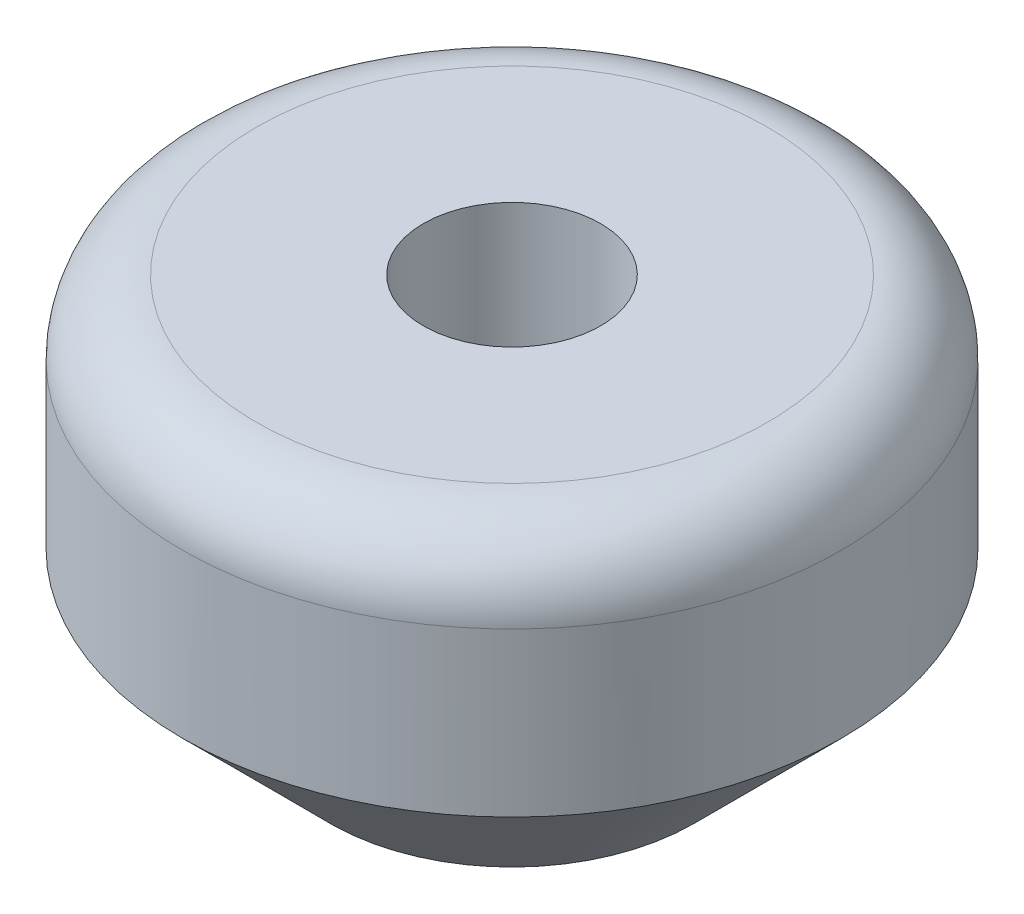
ISO-10303-21;
HEADER;
FILE_DESCRIPTION(('STEP AP214'),'2;1');
FILE_NAME('part.step','',(''),(''),'','','');
FILE_SCHEMA(('AUTOMOTIVE_DESIGN { 1 0 10303 214 1 1 1 1 }'));
ENDSEC;
DATA;
#1=APPLICATION_CONTEXT('core data for automotive mechanical design processes');
#2=APPLICATION_PROTOCOL_DEFINITION('international standard','automotive_design',2000,#1);
#3=PRODUCT_CONTEXT('',#1,'mechanical');
#4=PRODUCT('Part','Part','',(#3));
#5=PRODUCT_RELATED_PRODUCT_CATEGORY('part','',(#4));
#6=PRODUCT_DEFINITION_FORMATION('','',#4);
#7=PRODUCT_DEFINITION_CONTEXT('part definition',#1,'design');
#8=PRODUCT_DEFINITION('design','',#6,#7);
#9=PRODUCT_DEFINITION_SHAPE('','',#8);
#10=(LENGTH_UNIT() NAMED_UNIT(*) SI_UNIT(.MILLI.,.METRE.));
#11=(NAMED_UNIT(*) PLANE_ANGLE_UNIT() SI_UNIT($,.RADIAN.));
#12=(NAMED_UNIT(*) SI_UNIT($,.STERADIAN.) SOLID_ANGLE_UNIT());
#13=UNCERTAINTY_MEASURE_WITH_UNIT(LENGTH_MEASURE(1.E-05),#10,'distance_accuracy_value','');
#14=(GEOMETRIC_REPRESENTATION_CONTEXT(3) GLOBAL_UNCERTAINTY_ASSIGNED_CONTEXT((#13)) GLOBAL_UNIT_ASSIGNED_CONTEXT((#10,
#11,#12)) REPRESENTATION_CONTEXT('',''));
#15=CARTESIAN_POINT('',(0.,0.,0.));
#16=DIRECTION('',(0.,0.,1.));
#17=DIRECTION('',(1.,0.,0.));
#18=AXIS2_PLACEMENT_3D('',#15,#16,#17);
#19=CARTESIAN_POINT('',(-44.6030028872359,-133.507535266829,0.));
#20=DIRECTION('',(0.,-1.,0.));
#21=DIRECTION('',(1.,0.,0.));
#22=AXIS2_PLACEMENT_3D('',#19,#20,#21);
#23=PLANE('',#22);
#24=CARTESIAN_POINT('',(-1.1508312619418E-13,-133.507535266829,0.));
#25=DIRECTION('',(0.,-1.,0.));
#26=DIRECTION('',(1.,0.,0.));
#27=AXIS2_PLACEMENT_3D('',#24,#25,#26);
#28=CIRCLE('',#27,24.6030028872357);
#29=CARTESIAN_POINT('',(24.6030028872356,-133.507535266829,0.));
#30=VERTEX_POINT('',#29);
#31=EDGE_CURVE('E40',#30,#30,#28,.T.);
#32=ORIENTED_EDGE('',*,*,#31,.T.);
#33=EDGE_LOOP('',(#32));
#34=FACE_BOUND('',#33,.T.);
#35=CARTESIAN_POINT('',(-1.1508312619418E-13,-133.507535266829,0.));
#36=DIRECTION('',(0.,1.,0.));
#37=DIRECTION('',(-1.,0.,0.));
#38=AXIS2_PLACEMENT_3D('',#35,#36,#37);
#39=CIRCLE('',#38,8.00000000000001);
#40=CARTESIAN_POINT('',(-8.00000000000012,-133.507535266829,0.));
#41=VERTEX_POINT('',#40);
#42=EDGE_CURVE('E49',#41,#41,#39,.T.);
#43=ORIENTED_EDGE('',*,*,#42,.T.);
#44=EDGE_LOOP('',(#43));
#45=FACE_BOUND('',#44,.T.);
#46=ADVANCED_FACE('F30',(#34,#45),#23,.T.);
#47=CARTESIAN_POINT('',(-1.13107492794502E-13,-83.162980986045,0.));
#48=DIRECTION('',(0.,1.,0.));
#49=DIRECTION('',(-1.,0.,0.));
#50=AXIS2_PLACEMENT_3D('',#47,#48,#49);
#51=CYLINDRICAL_SURFACE('',#50,8.00000000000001);
#52=CARTESIAN_POINT('',(-1.14564843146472E-13,-120.300262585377,0.));
#53=DIRECTION('',(0.,1.,0.));
#54=DIRECTION('',(-1.,0.,0.));
#55=AXIS2_PLACEMENT_3D('',#52,#53,#54);
#56=CIRCLE('',#55,8.00000000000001);
#57=CARTESIAN_POINT('',(-8.00000000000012,-120.300262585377,0.));
#58=VERTEX_POINT('',#57);
#59=EDGE_CURVE('E52',#58,#58,#56,.T.);
#60=ORIENTED_EDGE('',*,*,#59,.T.);
#61=EDGE_LOOP('',(#60));
#62=FACE_BOUND('',#61,.T.);
#63=ORIENTED_EDGE('',*,*,#42,.F.);
#64=EDGE_LOOP('',(#63));
#65=FACE_BOUND('',#64,.T.);
#66=ADVANCED_FACE('F78',(#62,#65),#51,.F.);
#67=CARTESIAN_POINT('',(-1.14564843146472E-13,-120.300262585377,0.));
#68=DIRECTION('',(0.,1.,0.));
#69=DIRECTION('',(-1.,0.,0.));
#70=AXIS2_PLACEMENT_3D('',#67,#68,#69);
#71=CONICAL_SURFACE('',#70,8.00000000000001,0.189985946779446);
#72=CARTESIAN_POINT('',(-1.13748594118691E-13,-99.5,0.));
#73=DIRECTION('',(0.,1.,0.));
#74=DIRECTION('',(-1.,0.,0.));
#75=AXIS2_PLACEMENT_3D('',#72,#73,#74);
#76=CIRCLE('',#75,11.9999999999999);
#77=CARTESIAN_POINT('',(-12.,-99.5,0.));
#78=VERTEX_POINT('',#77);
#79=EDGE_CURVE('E55',#78,#78,#76,.T.);
#80=ORIENTED_EDGE('',*,*,#79,.T.);
#81=EDGE_LOOP('',(#80));
#82=FACE_BOUND('',#81,.T.);
#83=ORIENTED_EDGE('',*,*,#59,.F.);
#84=EDGE_LOOP('',(#83));
#85=FACE_BOUND('',#84,.T.);
#86=ADVANCED_FACE('F75',(#82,#85),#71,.F.);
#87=CARTESIAN_POINT('',(-1.13107492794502E-13,-83.162980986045,0.));
#88=DIRECTION('',(0.,1.,0.));
#89=DIRECTION('',(-1.,0.,0.));
#90=AXIS2_PLACEMENT_3D('',#87,#88,#89);
#91=CYLINDRICAL_SURFACE('',#90,11.9999999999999);
#92=CARTESIAN_POINT('',(-1.13040783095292E-13,-81.4630349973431,0.));
#93=DIRECTION('',(0.,1.,0.));
#94=DIRECTION('',(-1.,0.,0.));
#95=AXIS2_PLACEMENT_3D('',#92,#93,#94);
#96=CIRCLE('',#95,11.9999999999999);
#97=CARTESIAN_POINT('',(-12.,-81.4630349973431,0.));
#98=VERTEX_POINT('',#97);
#99=EDGE_CURVE('E58',#98,#98,#96,.T.);
#100=ORIENTED_EDGE('',*,*,#99,.T.);
#101=EDGE_LOOP('',(#100));
#102=FACE_BOUND('',#101,.T.);
#103=ORIENTED_EDGE('',*,*,#79,.F.);
#104=EDGE_LOOP('',(#103));
#105=FACE_BOUND('',#104,.T.);
#106=ADVANCED_FACE('F62',(#102,#105),#91,.F.);
#107=CARTESIAN_POINT('',(-12.,-81.4630349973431,0.));
#108=DIRECTION('',(0.,1.,0.));
#109=DIRECTION('',(-1.,0.,0.));
#110=AXIS2_PLACEMENT_3D('',#107,#108,#109);
#111=PLANE('',#110);
#112=CARTESIAN_POINT('',(-1.13040783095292E-13,-81.4630349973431,0.));
#113=DIRECTION('',(0.,1.,0.));
#114=DIRECTION('',(-1.,0.,0.));
#115=AXIS2_PLACEMENT_3D('',#112,#113,#114);
#116=CIRCLE('',#115,34.6030028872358);
#117=CARTESIAN_POINT('',(-34.6030028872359,-81.4630349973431,0.));
#118=VERTEX_POINT('',#117);
#119=EDGE_CURVE('E36',#118,#118,#116,.T.);
#120=ORIENTED_EDGE('',*,*,#119,.T.);
#121=EDGE_LOOP('',(#120));
#122=FACE_BOUND('',#121,.T.);
#123=ORIENTED_EDGE('',*,*,#99,.F.);
#124=EDGE_LOOP('',(#123));
#125=FACE_BOUND('',#124,.T.);
#126=ADVANCED_FACE('F65',(#122,#125),#111,.T.);
#127=CARTESIAN_POINT('',(-1.13107492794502E-13,-83.162980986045,0.));
#128=DIRECTION('',(0.,1.,0.));
#129=DIRECTION('',(-1.,0.,0.));
#130=AXIS2_PLACEMENT_3D('',#127,#128,#129);
#131=CYLINDRICAL_SURFACE('',#130,44.6030028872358);
#132=CARTESIAN_POINT('',(-1.13433205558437E-13,-91.4630349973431,0.));
#133=DIRECTION('',(0.,1.,0.));
#134=DIRECTION('',(-1.,0.,0.));
#135=AXIS2_PLACEMENT_3D('',#132,#133,#134);
#136=CIRCLE('',#135,44.6030028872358);
#137=CARTESIAN_POINT('',(-44.6030028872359,-91.4630349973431,0.));
#138=VERTEX_POINT('',#137);
#139=EDGE_CURVE('E10',#138,#138,#136,.F.);
#140=ORIENTED_EDGE('',*,*,#139,.T.);
#141=EDGE_LOOP('',(#140));
#142=FACE_BOUND('',#141,.T.);
#143=CARTESIAN_POINT('',(-1.14298281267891E-13,-113.507535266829,0.));
#144=DIRECTION('',(0.,-1.,0.));
#145=DIRECTION('',(1.,0.,0.));
#146=AXIS2_PLACEMENT_3D('',#143,#144,#145);
#147=CIRCLE('',#146,44.6030028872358);
#148=CARTESIAN_POINT('',(44.6030028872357,-113.507535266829,0.));
#149=VERTEX_POINT('',#148);
#150=EDGE_CURVE('E44',#149,#149,#147,.F.);
#151=ORIENTED_EDGE('',*,*,#150,.T.);
#152=EDGE_LOOP('',(#151));
#153=FACE_BOUND('',#152,.T.);
#154=ADVANCED_FACE('F67',(#142,#153),#131,.T.);
#155=CARTESIAN_POINT('',(-1.14298281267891E-13,-113.507535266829,0.));
#156=DIRECTION('',(0.,1.,0.));
#157=DIRECTION('',(-1.,0.,0.));
#158=AXIS2_PLACEMENT_3D('',#155,#156,#157);
#159=CONICAL_SURFACE('',#158,44.6030028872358,0.785398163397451);
#160=ORIENTED_EDGE('',*,*,#31,.F.);
#161=EDGE_LOOP('',(#160));
#162=FACE_BOUND('',#161,.T.);
#163=ORIENTED_EDGE('',*,*,#150,.F.);
#164=EDGE_LOOP('',(#163));
#165=FACE_BOUND('',#164,.T.);
#166=ADVANCED_FACE('F73',(#162,#165),#159,.T.);
#167=CARTESIAN_POINT('',(-1.13433205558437E-13,-91.4630349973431,0.));
#168=DIRECTION('',(0.,1.,0.));
#169=DIRECTION('',(-1.,0.,0.));
#170=AXIS2_PLACEMENT_3D('',#167,#168,#169);
#171=TOROIDAL_SURFACE('',#170,34.6030028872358,10.);
#172=ORIENTED_EDGE('',*,*,#139,.F.);
#173=EDGE_LOOP('',(#172));
#174=FACE_BOUND('',#173,.T.);
#175=ORIENTED_EDGE('',*,*,#119,.F.);
#176=EDGE_LOOP('',(#175));
#177=FACE_BOUND('',#176,.T.);
#178=ADVANCED_FACE('F91',(#174,#177),#171,.T.);
#179=CLOSED_SHELL('',(#46,#66,#86,#106,#126,#154,#166,#178));
#180=MANIFOLD_SOLID_BREP('B2',#179);
#181=ADVANCED_BREP_SHAPE_REPRESENTATION('',(#18,#180),#14);
#182=SHAPE_DEFINITION_REPRESENTATION(#9,#181);
ENDSEC;
END-ISO-10303-21;
